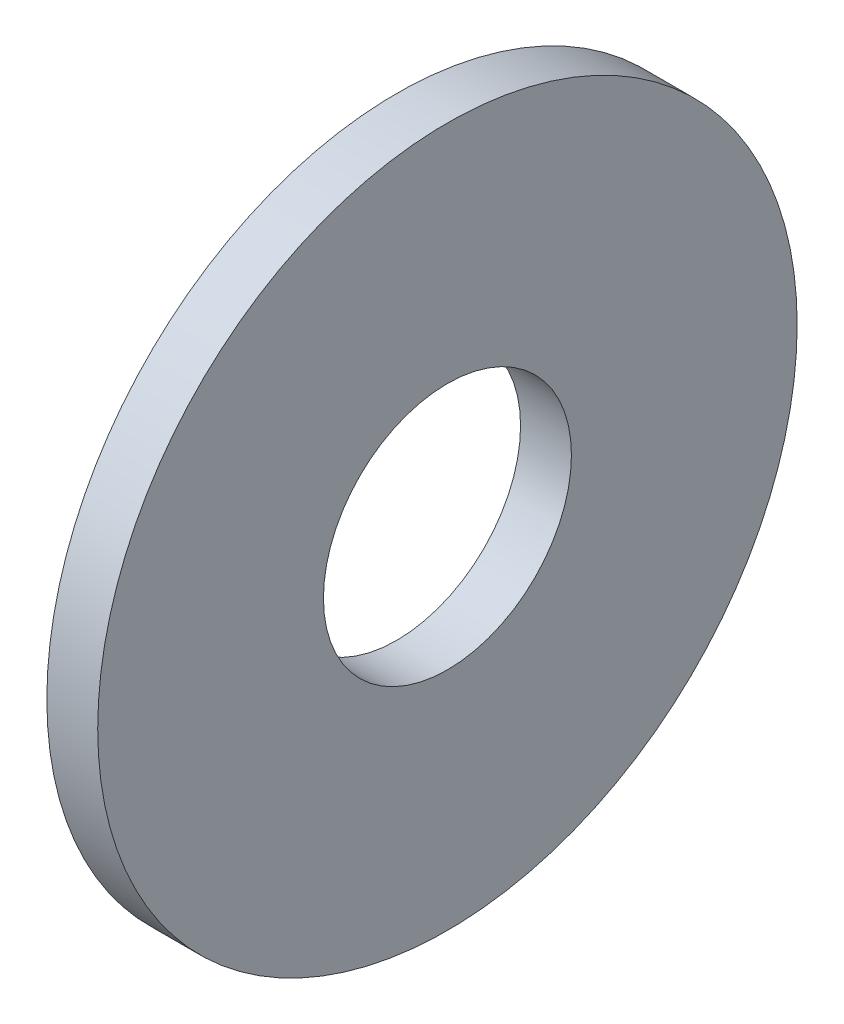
from build123d import *

# Parameters (mm, degrees)
SKETCH1_W = 8
SKETCH1_H = 35.5


with BuildPart() as part:
    # Sketch1 → Base-Revolve (revolve)
    with BuildSketch(Plane.XY, mode=Mode.PRIVATE) as base_revolve_sk:
        with Locations((-4, 37.25)):
            Rectangle(SKETCH1_W, SKETCH1_H)
    revolve(base_revolve_sk.sketch.rotate(Axis((-34.925, 0, 0), (1, 0, 0)), 90), axis=Axis((-34.925, 0, 0), (1, 0, 0)))


solid = part.part
